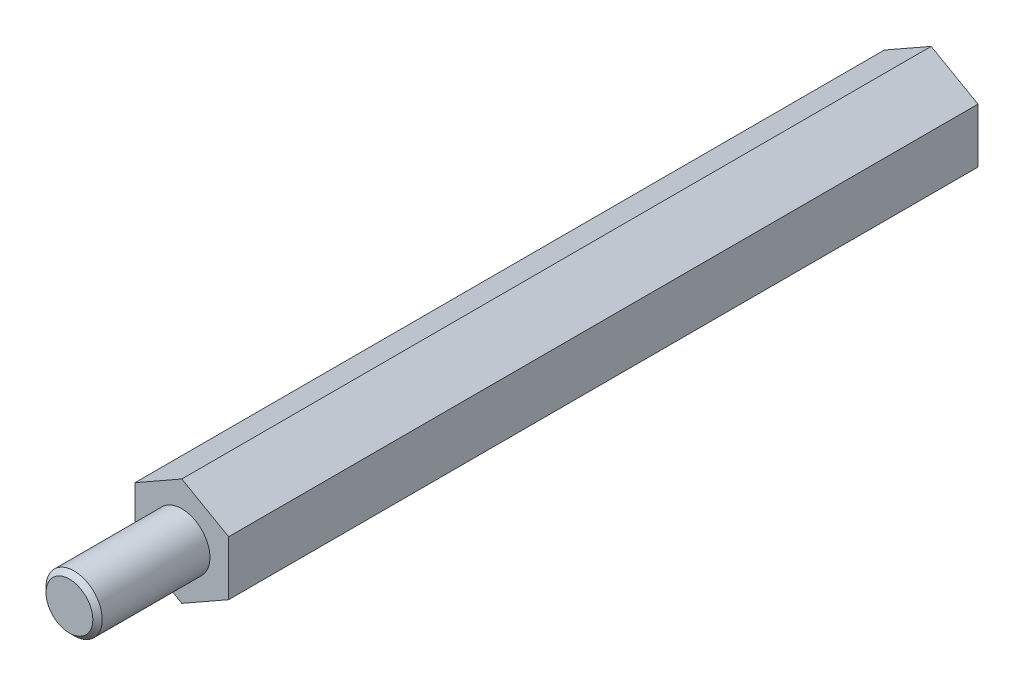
from build123d import *

# Parameters (mm, degrees)
EXTRUSION1_DEPTH            = 80
TROU_TARAUD_M61_D           = 5
TROU_TARAUD_M61_DEPTH       = 17
TROU_TARAUD_M61_CSINK_D     = 7
TROU_TARAUD_M61_CSINK_ANGLE = 90
TROU_TARAUD_M61_TIP         = 1.502151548
ESQUISSE3_R                 = 3
EXTRUSION2_DEPTH            = 12
CHANFREIN1_SIZE             = 0.5


with BuildPart() as part:
    # Esquisse1 → Extrusion1 (new body)
    with BuildSketch(Plane.XY):
        Polygon((5, -2.910545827), (5, 2.910545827), (0, 5.75), (-5, 2.910545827), (-5, -2.910545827), (0, -5.75), align=None)
    extrude(amount=EXTRUSION1_DEPTH)

    # Trou taraud_ M61
    with Locations(Plane(origin=(0, 0, 0), x_dir=(-1, 0, 0), z_dir=(0, 0, -1))):
        with Locations((0, 0)):
            CounterSinkHole(TROU_TARAUD_M61_D / 2, TROU_TARAUD_M61_CSINK_D / 2, depth=TROU_TARAUD_M61_DEPTH, counter_sink_angle=TROU_TARAUD_M61_CSINK_ANGLE)
            with Locations((0, 0, -(TROU_TARAUD_M61_DEPTH + TROU_TARAUD_M61_TIP / 2))):  # 118° drill point
                Cone(0, TROU_TARAUD_M61_D / 2, TROU_TARAUD_M61_TIP, mode=Mode.SUBTRACT)

    # Esquisse3 → Extrusion2 (add)
    with BuildSketch(Plane.XY.offset(80)):
        with Locations(Location((0, 0, 0), (0, 0, 180))):
            Circle(ESQUISSE3_R)
    extrude(amount=EXTRUSION2_DEPTH)

    # Chanfrein1
    chanfrein1_edges = [part.edges().sort_by_distance(p)[0] for p in [
        (3, 0, 92),
    ]]
    chamfer(chanfrein1_edges, length=CHANFREIN1_SIZE)


solid = part.part
